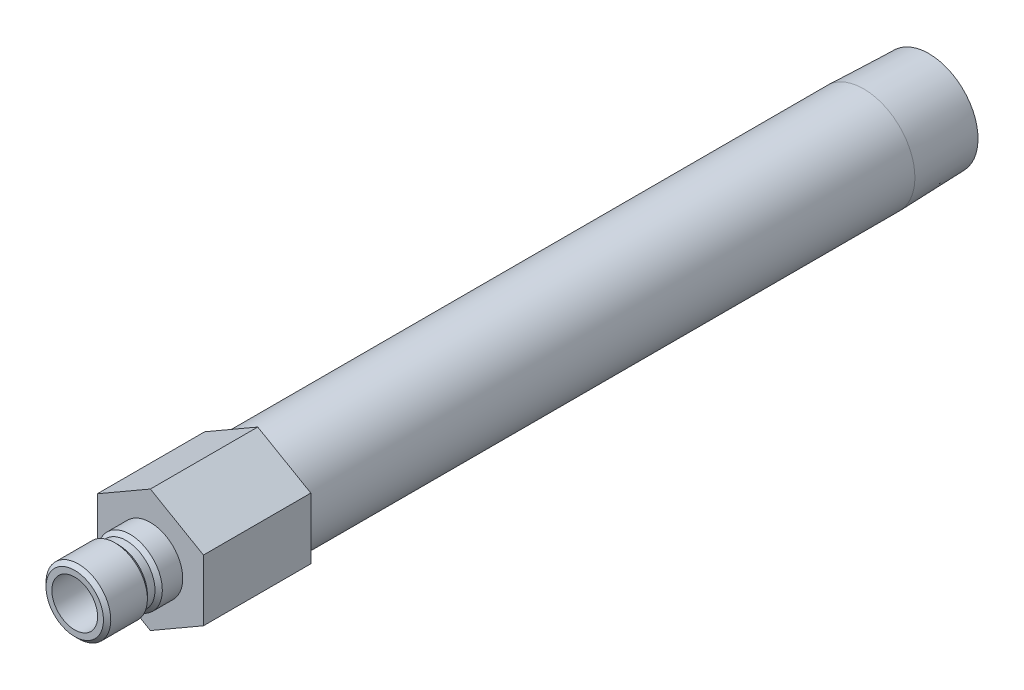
ISO-10303-21;
HEADER;
FILE_DESCRIPTION(('STEP AP214'),'2;1');
FILE_NAME('part.step','',(''),(''),'','','');
FILE_SCHEMA(('AUTOMOTIVE_DESIGN { 1 0 10303 214 1 1 1 1 }'));
ENDSEC;
DATA;
#1=APPLICATION_CONTEXT('core data for automotive mechanical design processes');
#2=APPLICATION_PROTOCOL_DEFINITION('international standard','automotive_design',2000,#1);
#3=PRODUCT_CONTEXT('',#1,'mechanical');
#4=PRODUCT('Part','Part','',(#3));
#5=PRODUCT_RELATED_PRODUCT_CATEGORY('part','',(#4));
#6=PRODUCT_DEFINITION_FORMATION('','',#4);
#7=PRODUCT_DEFINITION_CONTEXT('part definition',#1,'design');
#8=PRODUCT_DEFINITION('design','',#6,#7);
#9=PRODUCT_DEFINITION_SHAPE('','',#8);
#10=(LENGTH_UNIT() NAMED_UNIT(*) SI_UNIT(.MILLI.,.METRE.));
#11=(NAMED_UNIT(*) PLANE_ANGLE_UNIT() SI_UNIT($,.RADIAN.));
#12=(NAMED_UNIT(*) SI_UNIT($,.STERADIAN.) SOLID_ANGLE_UNIT());
#13=UNCERTAINTY_MEASURE_WITH_UNIT(LENGTH_MEASURE(1.E-05),#10,'distance_accuracy_value','');
#14=(GEOMETRIC_REPRESENTATION_CONTEXT(3) GLOBAL_UNCERTAINTY_ASSIGNED_CONTEXT((#13)) GLOBAL_UNIT_ASSIGNED_CONTEXT((#10,
#11,#12)) REPRESENTATION_CONTEXT('',''));
#15=CARTESIAN_POINT('',(0.,0.,0.));
#16=DIRECTION('',(0.,0.,1.));
#17=DIRECTION('',(1.,0.,0.));
#18=AXIS2_PLACEMENT_3D('',#15,#16,#17);
#19=CARTESIAN_POINT('',(0.,0.,0.));
#20=DIRECTION('',(0.,0.,-1.));
#21=DIRECTION('',(0.,1.,0.));
#22=AXIS2_PLACEMENT_3D('',#19,#20,#21);
#23=CYLINDRICAL_SURFACE('',#22,10.668);
#24=CARTESIAN_POINT('',(0.,0.,-148.4884));
#25=DIRECTION('',(0.,0.,-1.));
#26=DIRECTION('',(0.,1.,0.));
#27=AXIS2_PLACEMENT_3D('',#24,#25,#26);
#28=CIRCLE('',#27,10.668);
#29=CARTESIAN_POINT('',(0.,10.668,-148.4884));
#30=VERTEX_POINT('',#29);
#31=EDGE_CURVE('E168',#30,#30,#28,.T.);
#32=ORIENTED_EDGE('',*,*,#31,.F.);
#33=EDGE_LOOP('',(#32));
#34=FACE_BOUND('',#33,.T.);
#35=CARTESIAN_POINT('',(0.,0.,-22.352));
#36=DIRECTION('',(0.,0.,1.));
#37=DIRECTION('',(1.,0.,0.));
#38=AXIS2_PLACEMENT_3D('',#35,#36,#37);
#39=CIRCLE('',#38,10.668);
#40=CARTESIAN_POINT('',(10.668,0.,-22.352));
#41=VERTEX_POINT('',#40);
#42=EDGE_CURVE('E37',#41,#41,#39,.F.);
#43=ORIENTED_EDGE('',*,*,#42,.T.);
#44=EDGE_LOOP('',(#43));
#45=FACE_BOUND('',#44,.T.);
#46=ADVANCED_FACE('F33',(#34,#45),#23,.T.);
#47=CARTESIAN_POINT('',(0.,0.,0.));
#48=DIRECTION('',(0.,0.,-1.));
#49=DIRECTION('',(0.,1.,0.));
#50=AXIS2_PLACEMENT_3D('',#47,#48,#49);
#51=CYLINDRICAL_SURFACE('',#50,4.76249999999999);
#52=CARTESIAN_POINT('',(0.,0.,15.748));
#53=DIRECTION('',(0.,0.,-1.));
#54=DIRECTION('',(0.,1.,0.));
#55=AXIS2_PLACEMENT_3D('',#52,#53,#54);
#56=CIRCLE('',#55,4.7625);
#57=CARTESIAN_POINT('',(0.,4.7625,15.748));
#58=VERTEX_POINT('',#57);
#59=EDGE_CURVE('E144',#58,#58,#56,.T.);
#60=ORIENTED_EDGE('',*,*,#59,.F.);
#61=EDGE_LOOP('',(#60));
#62=FACE_BOUND('',#61,.T.);
#63=CARTESIAN_POINT('',(0.,0.,-22.352));
#64=DIRECTION('',(0.,0.,-1.));
#65=DIRECTION('',(0.,1.,0.));
#66=AXIS2_PLACEMENT_3D('',#63,#64,#65);
#67=CIRCLE('',#66,4.76249999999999);
#68=CARTESIAN_POINT('',(0.,4.7625,-22.352));
#69=VERTEX_POINT('',#68);
#70=EDGE_CURVE('E11',#69,#69,#67,.T.);
#71=ORIENTED_EDGE('',*,*,#70,.T.);
#72=EDGE_LOOP('',(#71));
#73=FACE_BOUND('',#72,.T.);
#74=ADVANCED_FACE('F35',(#62,#73),#51,.F.);
#75=CARTESIAN_POINT('',(0.,4.7625,-22.352));
#76=DIRECTION('',(0.,0.,-1.));
#77=DIRECTION('',(0.,1.,0.));
#78=AXIS2_PLACEMENT_3D('',#75,#76,#77);
#79=PLANE('',#78);
#80=CARTESIAN_POINT('',(0.,0.,-22.352));
#81=DIRECTION('',(0.,0.,-1.));
#82=DIRECTION('',(0.,1.,0.));
#83=AXIS2_PLACEMENT_3D('',#80,#81,#82);
#84=CIRCLE('',#83,7.89939999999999);
#85=CARTESIAN_POINT('',(0.,7.8994,-22.352));
#86=VERTEX_POINT('',#85);
#87=EDGE_CURVE('E43',#86,#86,#84,.T.);
#88=ORIENTED_EDGE('',*,*,#87,.T.);
#89=EDGE_LOOP('',(#88));
#90=FACE_BOUND('',#89,.T.);
#91=ORIENTED_EDGE('',*,*,#70,.F.);
#92=EDGE_LOOP('',(#91));
#93=FACE_BOUND('',#92,.T.);
#94=ADVANCED_FACE('F180',(#90,#93),#79,.T.);
#95=CARTESIAN_POINT('',(0.,0.,0.));
#96=DIRECTION('',(0.,0.,-1.));
#97=DIRECTION('',(0.,1.,0.));
#98=AXIS2_PLACEMENT_3D('',#95,#96,#97);
#99=CYLINDRICAL_SURFACE('',#98,7.89939999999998);
#100=CARTESIAN_POINT('',(0.,0.,-162.052));
#101=DIRECTION('',(0.,0.,-1.));
#102=DIRECTION('',(0.,1.,0.));
#103=AXIS2_PLACEMENT_3D('',#100,#101,#102);
#104=CIRCLE('',#103,7.89939999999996);
#105=CARTESIAN_POINT('',(0.,7.8994,-162.052));
#106=VERTEX_POINT('',#105);
#107=EDGE_CURVE('E174',#106,#106,#104,.T.);
#108=ORIENTED_EDGE('',*,*,#107,.T.);
#109=EDGE_LOOP('',(#108));
#110=FACE_BOUND('',#109,.T.);
#111=ORIENTED_EDGE('',*,*,#87,.F.);
#112=EDGE_LOOP('',(#111));
#113=FACE_BOUND('',#112,.T.);
#114=ADVANCED_FACE('F183',(#110,#113),#99,.F.);
#115=CARTESIAN_POINT('',(0.,10.244140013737,-162.052));
#116=DIRECTION('',(0.,0.,-1.));
#117=DIRECTION('',(0.,1.,0.));
#118=AXIS2_PLACEMENT_3D('',#115,#116,#117);
#119=PLANE('',#118);
#120=CARTESIAN_POINT('',(0.,0.,-162.052));
#121=DIRECTION('',(0.,0.,-1.));
#122=DIRECTION('',(0.,1.,0.));
#123=AXIS2_PLACEMENT_3D('',#120,#121,#122);
#124=CIRCLE('',#123,10.2441400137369);
#125=CARTESIAN_POINT('',(0.,10.244140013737,-162.052));
#126=VERTEX_POINT('',#125);
#127=EDGE_CURVE('E171',#126,#126,#124,.T.);
#128=ORIENTED_EDGE('',*,*,#127,.T.);
#129=EDGE_LOOP('',(#128));
#130=FACE_BOUND('',#129,.T.);
#131=ORIENTED_EDGE('',*,*,#107,.F.);
#132=EDGE_LOOP('',(#131));
#133=FACE_BOUND('',#132,.T.);
#134=ADVANCED_FACE('F185',(#130,#133),#119,.T.);
#135=CARTESIAN_POINT('',(0.,0.,-162.052));
#136=DIRECTION('',(0.,0.,1.));
#137=DIRECTION('',(0.,-1.,0.));
#138=AXIS2_PLACEMENT_3D('',#135,#136,#137);
#139=CONICAL_SURFACE('',#138,10.2441400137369,0.0312396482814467);
#140=ORIENTED_EDGE('',*,*,#31,.T.);
#141=EDGE_LOOP('',(#140));
#142=FACE_BOUND('',#141,.T.);
#143=ORIENTED_EDGE('',*,*,#127,.F.);
#144=EDGE_LOOP('',(#143));
#145=FACE_BOUND('',#144,.T.);
#146=ADVANCED_FACE('F192',(#142,#145),#139,.T.);
#147=CARTESIAN_POINT('',(0.,6.7437,0.));
#148=DIRECTION('',(0.,0.,1.));
#149=DIRECTION('',(0.,-1.,0.));
#150=AXIS2_PLACEMENT_3D('',#147,#148,#149);
#151=PLANE('',#150);
#152=CARTESIAN_POINT('',(0.,0.,0.));
#153=DIRECTION('',(0.,0.,-1.));
#154=DIRECTION('',(0.,1.,0.));
#155=AXIS2_PLACEMENT_3D('',#152,#153,#154);
#156=CIRCLE('',#155,6.7437);
#157=CARTESIAN_POINT('',(0.,6.7437,0.));
#158=VERTEX_POINT('',#157);
#159=EDGE_CURVE('E165',#158,#158,#156,.T.);
#160=ORIENTED_EDGE('',*,*,#159,.T.);
#161=EDGE_LOOP('',(#160));
#162=FACE_BOUND('',#161,.T.);
#163=DIRECTION('',(-0.866025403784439,-0.5,0.));
#164=VECTOR('',#163,1.);
#165=CARTESIAN_POINT('',(0.,12.7582862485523,0.));
#166=LINE('',#165,#164);
#167=CARTESIAN_POINT('',(0.,12.7582862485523,0.));
#168=VERTEX_POINT('',#167);
#169=CARTESIAN_POINT('',(-11.049,6.37914312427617,0.));
#170=VERTEX_POINT('',#169);
#171=EDGE_CURVE('E122',#168,#170,#166,.T.);
#172=ORIENTED_EDGE('',*,*,#171,.T.);
#173=DIRECTION('',(0.,-1.,0.));
#174=VECTOR('',#173,1.);
#175=CARTESIAN_POINT('',(-11.049,6.37914312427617,0.));
#176=LINE('',#175,#174);
#177=CARTESIAN_POINT('',(-11.049,-6.37914312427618,0.));
#178=VERTEX_POINT('',#177);
#179=EDGE_CURVE('E125',#170,#178,#176,.T.);
#180=ORIENTED_EDGE('',*,*,#179,.T.);
#181=DIRECTION('',(0.866025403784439,-0.5,0.));
#182=VECTOR('',#181,1.);
#183=CARTESIAN_POINT('',(-11.049,-6.37914312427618,0.));
#184=LINE('',#183,#182);
#185=CARTESIAN_POINT('',(0.,-12.7582862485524,0.));
#186=VERTEX_POINT('',#185);
#187=EDGE_CURVE('E128',#178,#186,#184,.T.);
#188=ORIENTED_EDGE('',*,*,#187,.T.);
#189=DIRECTION('',(0.866025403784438,0.5,0.));
#190=VECTOR('',#189,1.);
#191=CARTESIAN_POINT('',(0.,-12.7582862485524,0.));
#192=LINE('',#191,#190);
#193=CARTESIAN_POINT('',(11.049,-6.37914312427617,0.));
#194=VERTEX_POINT('',#193);
#195=EDGE_CURVE('E131',#186,#194,#192,.T.);
#196=ORIENTED_EDGE('',*,*,#195,.T.);
#197=DIRECTION('',(0.,1.,0.));
#198=VECTOR('',#197,1.);
#199=CARTESIAN_POINT('',(11.049,-6.37914312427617,0.));
#200=LINE('',#199,#198);
#201=CARTESIAN_POINT('',(11.049,6.37914312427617,0.));
#202=VERTEX_POINT('',#201);
#203=EDGE_CURVE('E99',#194,#202,#200,.T.);
#204=ORIENTED_EDGE('',*,*,#203,.T.);
#205=DIRECTION('',(-0.866025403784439,0.5,0.));
#206=VECTOR('',#205,1.);
#207=CARTESIAN_POINT('',(11.049,6.37914312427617,0.));
#208=LINE('',#207,#206);
#209=EDGE_CURVE('E134',#202,#168,#208,.T.);
#210=ORIENTED_EDGE('',*,*,#209,.T.);
#211=EDGE_LOOP('',(#172,#180,#188,#196,#204,#210));
#212=FACE_BOUND('',#211,.T.);
#213=ADVANCED_FACE('F206',(#162,#212),#151,.T.);
#214=CARTESIAN_POINT('',(0.,0.,0.));
#215=DIRECTION('',(0.,0.,-1.));
#216=DIRECTION('',(0.,1.,0.));
#217=AXIS2_PLACEMENT_3D('',#214,#215,#216);
#218=CYLINDRICAL_SURFACE('',#217,6.7437);
#219=CARTESIAN_POINT('',(0.,0.,4.25449999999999));
#220=DIRECTION('',(0.,0.,-1.));
#221=DIRECTION('',(0.,1.,0.));
#222=AXIS2_PLACEMENT_3D('',#219,#220,#221);
#223=CIRCLE('',#222,6.7437);
#224=CARTESIAN_POINT('',(0.,6.7437,4.25449999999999));
#225=VERTEX_POINT('',#224);
#226=EDGE_CURVE('E162',#225,#225,#223,.T.);
#227=ORIENTED_EDGE('',*,*,#226,.T.);
#228=EDGE_LOOP('',(#227));
#229=FACE_BOUND('',#228,.T.);
#230=ORIENTED_EDGE('',*,*,#159,.F.);
#231=EDGE_LOOP('',(#230));
#232=FACE_BOUND('',#231,.T.);
#233=ADVANCED_FACE('F213',(#229,#232),#218,.T.);
#234=CARTESIAN_POINT('',(0.,0.,4.25449999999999));
#235=DIRECTION('',(0.,0.,-1.));
#236=DIRECTION('',(0.,1.,0.));
#237=AXIS2_PLACEMENT_3D('',#234,#235,#236);
#238=CONICAL_SURFACE('',#237,6.7437,0.785398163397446);
#239=CARTESIAN_POINT('',(0.,0.,5.0165));
#240=DIRECTION('',(0.,0.,-1.));
#241=DIRECTION('',(0.,1.,0.));
#242=AXIS2_PLACEMENT_3D('',#239,#240,#241);
#243=CIRCLE('',#242,5.9817);
#244=CARTESIAN_POINT('',(0.,5.9817,5.0165));
#245=VERTEX_POINT('',#244);
#246=EDGE_CURVE('E159',#245,#245,#243,.T.);
#247=ORIENTED_EDGE('',*,*,#246,.T.);
#248=EDGE_LOOP('',(#247));
#249=FACE_BOUND('',#248,.T.);
#250=ORIENTED_EDGE('',*,*,#226,.F.);
#251=EDGE_LOOP('',(#250));
#252=FACE_BOUND('',#251,.T.);
#253=ADVANCED_FACE('F222',(#249,#252),#238,.T.);
#254=CARTESIAN_POINT('',(0.,0.,0.));
#255=DIRECTION('',(0.,0.,-1.));
#256=DIRECTION('',(0.,1.,0.));
#257=AXIS2_PLACEMENT_3D('',#254,#255,#256);
#258=CYLINDRICAL_SURFACE('',#257,5.9817);
#259=CARTESIAN_POINT('',(0.,0.,6.604));
#260=DIRECTION('',(0.,0.,-1.));
#261=DIRECTION('',(0.,1.,0.));
#262=AXIS2_PLACEMENT_3D('',#259,#260,#261);
#263=CIRCLE('',#262,5.9817);
#264=CARTESIAN_POINT('',(0.,5.9817,6.604));
#265=VERTEX_POINT('',#264);
#266=EDGE_CURVE('E156',#265,#265,#263,.T.);
#267=ORIENTED_EDGE('',*,*,#266,.T.);
#268=EDGE_LOOP('',(#267));
#269=FACE_BOUND('',#268,.T.);
#270=ORIENTED_EDGE('',*,*,#246,.F.);
#271=EDGE_LOOP('',(#270));
#272=FACE_BOUND('',#271,.T.);
#273=ADVANCED_FACE('F263',(#269,#272),#258,.T.);
#274=CARTESIAN_POINT('',(0.,0.,6.604));
#275=DIRECTION('',(0.,0.,1.));
#276=DIRECTION('',(0.,-1.,0.));
#277=AXIS2_PLACEMENT_3D('',#274,#275,#276);
#278=CONICAL_SURFACE('',#277,5.9817,0.785398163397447);
#279=CARTESIAN_POINT('',(0.,0.,7.366));
#280=DIRECTION('',(0.,0.,-1.));
#281=DIRECTION('',(0.,1.,0.));
#282=AXIS2_PLACEMENT_3D('',#279,#280,#281);
#283=CIRCLE('',#282,6.7437);
#284=CARTESIAN_POINT('',(0.,6.7437,7.366));
#285=VERTEX_POINT('',#284);
#286=EDGE_CURVE('E153',#285,#285,#283,.T.);
#287=ORIENTED_EDGE('',*,*,#286,.T.);
#288=EDGE_LOOP('',(#287));
#289=FACE_BOUND('',#288,.T.);
#290=ORIENTED_EDGE('',*,*,#266,.F.);
#291=EDGE_LOOP('',(#290));
#292=FACE_BOUND('',#291,.T.);
#293=ADVANCED_FACE('F259',(#289,#292),#278,.T.);
#294=CARTESIAN_POINT('',(0.,0.,0.));
#295=DIRECTION('',(0.,0.,-1.));
#296=DIRECTION('',(0.,1.,0.));
#297=AXIS2_PLACEMENT_3D('',#294,#295,#296);
#298=CYLINDRICAL_SURFACE('',#297,6.7437);
#299=CARTESIAN_POINT('',(0.,0.,14.986));
#300=DIRECTION('',(0.,0.,-1.));
#301=DIRECTION('',(0.,1.,0.));
#302=AXIS2_PLACEMENT_3D('',#299,#300,#301);
#303=CIRCLE('',#302,6.7437);
#304=CARTESIAN_POINT('',(0.,6.7437,14.986));
#305=VERTEX_POINT('',#304);
#306=EDGE_CURVE('E150',#305,#305,#303,.T.);
#307=ORIENTED_EDGE('',*,*,#306,.T.);
#308=EDGE_LOOP('',(#307));
#309=FACE_BOUND('',#308,.T.);
#310=ORIENTED_EDGE('',*,*,#286,.F.);
#311=EDGE_LOOP('',(#310));
#312=FACE_BOUND('',#311,.T.);
#313=ADVANCED_FACE('F255',(#309,#312),#298,.T.);
#314=CARTESIAN_POINT('',(0.,0.,14.986));
#315=DIRECTION('',(0.,0.,-1.));
#316=DIRECTION('',(0.,1.,0.));
#317=AXIS2_PLACEMENT_3D('',#314,#315,#316);
#318=CONICAL_SURFACE('',#317,6.7437,0.785398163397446);
#319=CARTESIAN_POINT('',(0.,0.,15.748));
#320=DIRECTION('',(0.,0.,-1.));
#321=DIRECTION('',(0.,1.,0.));
#322=AXIS2_PLACEMENT_3D('',#319,#320,#321);
#323=CIRCLE('',#322,5.9817);
#324=CARTESIAN_POINT('',(0.,5.9817,15.748));
#325=VERTEX_POINT('',#324);
#326=EDGE_CURVE('E147',#325,#325,#323,.T.);
#327=ORIENTED_EDGE('',*,*,#326,.T.);
#328=EDGE_LOOP('',(#327));
#329=FACE_BOUND('',#328,.T.);
#330=ORIENTED_EDGE('',*,*,#306,.F.);
#331=EDGE_LOOP('',(#330));
#332=FACE_BOUND('',#331,.T.);
#333=ADVANCED_FACE('F251',(#329,#332),#318,.T.);
#334=CARTESIAN_POINT('',(0.,4.7625,15.748));
#335=DIRECTION('',(0.,0.,1.));
#336=DIRECTION('',(0.,-1.,0.));
#337=AXIS2_PLACEMENT_3D('',#334,#335,#336);
#338=PLANE('',#337);
#339=ORIENTED_EDGE('',*,*,#59,.T.);
#340=EDGE_LOOP('',(#339));
#341=FACE_BOUND('',#340,.T.);
#342=ORIENTED_EDGE('',*,*,#326,.F.);
#343=EDGE_LOOP('',(#342));
#344=FACE_BOUND('',#343,.T.);
#345=ADVANCED_FACE('F239',(#341,#344),#338,.T.);
#346=CARTESIAN_POINT('',(0.,12.7582862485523,-22.352));
#347=DIRECTION('',(-0.5,0.866025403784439,0.));
#348=DIRECTION('',(-0.866025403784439,-0.5,0.));
#349=AXIS2_PLACEMENT_3D('',#346,#347,#348);
#350=PLANE('',#349);
#351=ORIENTED_EDGE('',*,*,#171,.F.);
#352=DIRECTION('',(0.,0.,1.));
#353=VECTOR('',#352,1.);
#354=CARTESIAN_POINT('',(0.,12.7582862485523,-22.352));
#355=LINE('',#354,#353);
#356=CARTESIAN_POINT('',(0.,12.7582862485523,-22.352));
#357=VERTEX_POINT('',#356);
#358=EDGE_CURVE('E51',#357,#168,#355,.T.);
#359=ORIENTED_EDGE('',*,*,#358,.F.);
#360=DIRECTION('',(-0.866025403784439,-0.5,0.));
#361=VECTOR('',#360,1.);
#362=CARTESIAN_POINT('',(0.,12.7582862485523,-22.352));
#363=LINE('',#362,#361);
#364=CARTESIAN_POINT('',(-11.049,6.37914312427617,-22.352));
#365=VERTEX_POINT('',#364);
#366=EDGE_CURVE('E137',#357,#365,#363,.T.);
#367=ORIENTED_EDGE('',*,*,#366,.T.);
#368=DIRECTION('',(0.,0.,1.));
#369=VECTOR('',#368,1.);
#370=CARTESIAN_POINT('',(-11.049,6.37914312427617,-22.352));
#371=LINE('',#370,#369);
#372=EDGE_CURVE('E86',#365,#170,#371,.T.);
#373=ORIENTED_EDGE('',*,*,#372,.T.);
#374=EDGE_LOOP('',(#351,#359,#367,#373));
#375=FACE_BOUND('',#374,.T.);
#376=ADVANCED_FACE('F226',(#375),#350,.T.);
#377=CARTESIAN_POINT('',(11.049,6.37914312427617,-22.352));
#378=DIRECTION('',(0.5,0.866025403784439,0.));
#379=DIRECTION('',(-0.866025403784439,0.5,0.));
#380=AXIS2_PLACEMENT_3D('',#377,#378,#379);
#381=PLANE('',#380);
#382=ORIENTED_EDGE('',*,*,#209,.F.);
#383=DIRECTION('',(0.,0.,1.));
#384=VECTOR('',#383,1.);
#385=CARTESIAN_POINT('',(11.049,6.37914312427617,-22.352));
#386=LINE('',#385,#384);
#387=CARTESIAN_POINT('',(11.049,6.37914312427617,-22.352));
#388=VERTEX_POINT('',#387);
#389=EDGE_CURVE('E74',#388,#202,#386,.T.);
#390=ORIENTED_EDGE('',*,*,#389,.F.);
#391=DIRECTION('',(-0.866025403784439,0.5,0.));
#392=VECTOR('',#391,1.);
#393=CARTESIAN_POINT('',(11.049,6.37914312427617,-22.352));
#394=LINE('',#393,#392);
#395=EDGE_CURVE('E112',#388,#357,#394,.T.);
#396=ORIENTED_EDGE('',*,*,#395,.T.);
#397=ORIENTED_EDGE('',*,*,#358,.T.);
#398=EDGE_LOOP('',(#382,#390,#396,#397));
#399=FACE_BOUND('',#398,.T.);
#400=ADVANCED_FACE('F231',(#399),#381,.T.);
#401=CARTESIAN_POINT('',(11.049,-6.37914312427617,-22.352));
#402=DIRECTION('',(1.,0.,0.));
#403=DIRECTION('',(0.,0.,-1.));
#404=AXIS2_PLACEMENT_3D('',#401,#402,#403);
#405=PLANE('',#404);
#406=ORIENTED_EDGE('',*,*,#203,.F.);
#407=DIRECTION('',(0.,0.,1.));
#408=VECTOR('',#407,1.);
#409=CARTESIAN_POINT('',(11.049,-6.37914312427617,-22.352));
#410=LINE('',#409,#408);
#411=CARTESIAN_POINT('',(11.049,-6.37914312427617,-22.352));
#412=VERTEX_POINT('',#411);
#413=EDGE_CURVE('E94',#412,#194,#410,.T.);
#414=ORIENTED_EDGE('',*,*,#413,.F.);
#415=DIRECTION('',(0.,1.,0.));
#416=VECTOR('',#415,1.);
#417=CARTESIAN_POINT('',(11.049,-6.37914312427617,-22.352));
#418=LINE('',#417,#416);
#419=EDGE_CURVE('E97',#412,#388,#418,.T.);
#420=ORIENTED_EDGE('',*,*,#419,.T.);
#421=ORIENTED_EDGE('',*,*,#389,.T.);
#422=EDGE_LOOP('',(#406,#414,#420,#421));
#423=FACE_BOUND('',#422,.T.);
#424=ADVANCED_FACE('F96',(#423),#405,.T.);
#425=CARTESIAN_POINT('',(0.,-12.7582862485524,-22.352));
#426=DIRECTION('',(0.5,-0.866025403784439,0.));
#427=DIRECTION('',(0.866025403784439,0.5,0.));
#428=AXIS2_PLACEMENT_3D('',#425,#426,#427);
#429=PLANE('',#428);
#430=ORIENTED_EDGE('',*,*,#195,.F.);
#431=DIRECTION('',(0.,0.,1.));
#432=VECTOR('',#431,1.);
#433=CARTESIAN_POINT('',(0.,-12.7582862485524,-22.352));
#434=LINE('',#433,#432);
#435=CARTESIAN_POINT('',(0.,-12.7582862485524,-22.352));
#436=VERTEX_POINT('',#435);
#437=EDGE_CURVE('E104',#436,#186,#434,.T.);
#438=ORIENTED_EDGE('',*,*,#437,.F.);
#439=DIRECTION('',(0.866025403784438,0.5,0.));
#440=VECTOR('',#439,1.);
#441=CARTESIAN_POINT('',(0.,-12.7582862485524,-22.352));
#442=LINE('',#441,#440);
#443=EDGE_CURVE('E110',#436,#412,#442,.T.);
#444=ORIENTED_EDGE('',*,*,#443,.T.);
#445=ORIENTED_EDGE('',*,*,#413,.T.);
#446=EDGE_LOOP('',(#430,#438,#444,#445));
#447=FACE_BOUND('',#446,.T.);
#448=ADVANCED_FACE('F114',(#447),#429,.T.);
#449=CARTESIAN_POINT('',(-11.049,-6.37914312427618,-22.352));
#450=DIRECTION('',(-0.5,-0.866025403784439,0.));
#451=DIRECTION('',(0.866025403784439,-0.5,0.));
#452=AXIS2_PLACEMENT_3D('',#449,#450,#451);
#453=PLANE('',#452);
#454=ORIENTED_EDGE('',*,*,#187,.F.);
#455=DIRECTION('',(0.,0.,1.));
#456=VECTOR('',#455,1.);
#457=CARTESIAN_POINT('',(-11.049,-6.37914312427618,-22.352));
#458=LINE('',#457,#456);
#459=CARTESIAN_POINT('',(-11.049,-6.37914312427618,-22.352));
#460=VERTEX_POINT('',#459);
#461=EDGE_CURVE('E141',#460,#178,#458,.T.);
#462=ORIENTED_EDGE('',*,*,#461,.F.);
#463=DIRECTION('',(0.866025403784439,-0.5,0.));
#464=VECTOR('',#463,1.);
#465=CARTESIAN_POINT('',(-11.049,-6.37914312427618,-22.352));
#466=LINE('',#465,#464);
#467=EDGE_CURVE('E115',#460,#436,#466,.T.);
#468=ORIENTED_EDGE('',*,*,#467,.T.);
#469=ORIENTED_EDGE('',*,*,#437,.T.);
#470=EDGE_LOOP('',(#454,#462,#468,#469));
#471=FACE_BOUND('',#470,.T.);
#472=ADVANCED_FACE('F230',(#471),#453,.T.);
#473=CARTESIAN_POINT('',(-11.049,6.37914312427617,-22.352));
#474=DIRECTION('',(-1.,0.,0.));
#475=DIRECTION('',(0.,0.,1.));
#476=AXIS2_PLACEMENT_3D('',#473,#474,#475);
#477=PLANE('',#476);
#478=ORIENTED_EDGE('',*,*,#179,.F.);
#479=ORIENTED_EDGE('',*,*,#372,.F.);
#480=DIRECTION('',(0.,-1.,0.));
#481=VECTOR('',#480,1.);
#482=CARTESIAN_POINT('',(-11.049,6.37914312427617,-22.352));
#483=LINE('',#482,#481);
#484=EDGE_CURVE('E117',#365,#460,#483,.T.);
#485=ORIENTED_EDGE('',*,*,#484,.T.);
#486=ORIENTED_EDGE('',*,*,#461,.T.);
#487=EDGE_LOOP('',(#478,#479,#485,#486));
#488=FACE_BOUND('',#487,.T.);
#489=ADVANCED_FACE('F227',(#488),#477,.T.);
#490=CARTESIAN_POINT('',(-11.049,6.37914312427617,-22.352));
#491=DIRECTION('',(0.,0.,1.));
#492=DIRECTION('',(1.,0.,0.));
#493=AXIS2_PLACEMENT_3D('',#490,#491,#492);
#494=PLANE('',#493);
#495=ORIENTED_EDGE('',*,*,#42,.F.);
#496=EDGE_LOOP('',(#495));
#497=FACE_BOUND('',#496,.T.);
#498=ORIENTED_EDGE('',*,*,#366,.F.);
#499=ORIENTED_EDGE('',*,*,#395,.F.);
#500=ORIENTED_EDGE('',*,*,#419,.F.);
#501=ORIENTED_EDGE('',*,*,#443,.F.);
#502=ORIENTED_EDGE('',*,*,#467,.F.);
#503=ORIENTED_EDGE('',*,*,#484,.F.);
#504=EDGE_LOOP('',(#498,#499,#500,#501,#502,#503));
#505=FACE_BOUND('',#504,.T.);
#506=ADVANCED_FACE('F108',(#497,#505),#494,.F.);
#507=CLOSED_SHELL('',(#46,#74,#94,#114,#134,#146,#213,#233,#253,#273,#293,#313,#333,#345,#376,
#400,#424,#448,#472,#489,#506));
#508=MANIFOLD_SOLID_BREP('B2',#507);
#509=ADVANCED_BREP_SHAPE_REPRESENTATION('',(#18,#508),#14);
#510=SHAPE_DEFINITION_REPRESENTATION(#9,#509);
ENDSEC;
END-ISO-10303-21;
